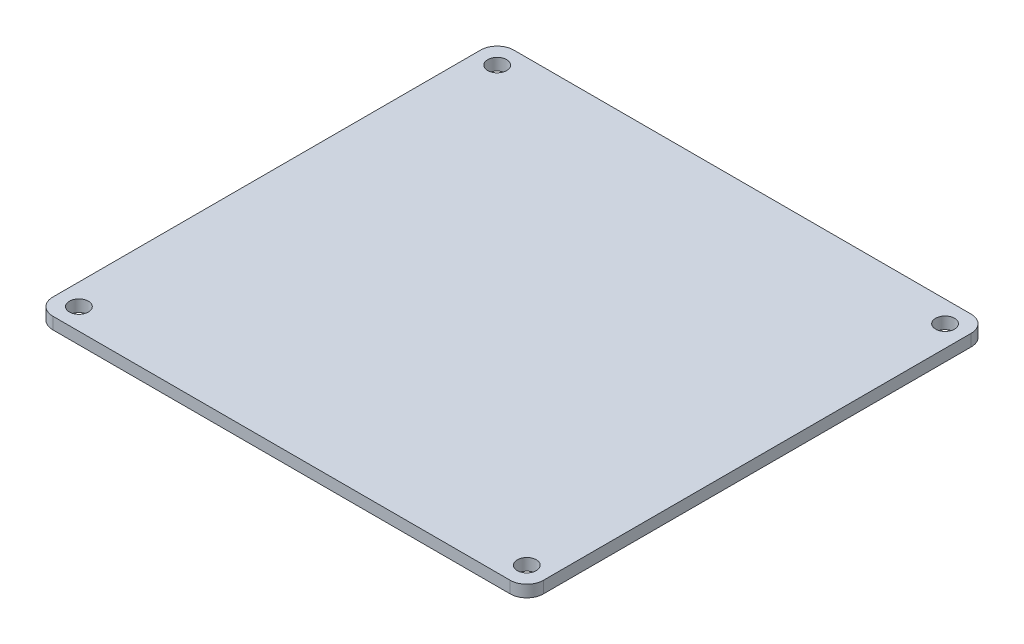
ISO-10303-21;
HEADER;
FILE_DESCRIPTION(('STEP AP214'),'2;1');
FILE_NAME('part.step','',(''),(''),'','','');
FILE_SCHEMA(('AUTOMOTIVE_DESIGN { 1 0 10303 214 1 1 1 1 }'));
ENDSEC;
DATA;
#1=APPLICATION_CONTEXT('core data for automotive mechanical design processes');
#2=APPLICATION_PROTOCOL_DEFINITION('international standard','automotive_design',2000,#1);
#3=PRODUCT_CONTEXT('',#1,'mechanical');
#4=PRODUCT('Part','Part','',(#3));
#5=PRODUCT_RELATED_PRODUCT_CATEGORY('part','',(#4));
#6=PRODUCT_DEFINITION_FORMATION('','',#4);
#7=PRODUCT_DEFINITION_CONTEXT('part definition',#1,'design');
#8=PRODUCT_DEFINITION('design','',#6,#7);
#9=PRODUCT_DEFINITION_SHAPE('','',#8);
#10=(LENGTH_UNIT() NAMED_UNIT(*) SI_UNIT(.MILLI.,.METRE.));
#11=(NAMED_UNIT(*) PLANE_ANGLE_UNIT() SI_UNIT($,.RADIAN.));
#12=(NAMED_UNIT(*) SI_UNIT($,.STERADIAN.) SOLID_ANGLE_UNIT());
#13=UNCERTAINTY_MEASURE_WITH_UNIT(LENGTH_MEASURE(1.E-05),#10,'distance_accuracy_value','');
#14=(GEOMETRIC_REPRESENTATION_CONTEXT(3) GLOBAL_UNCERTAINTY_ASSIGNED_CONTEXT((#13)) GLOBAL_UNIT_ASSIGNED_CONTEXT((#10,
#11,#12)) REPRESENTATION_CONTEXT('',''));
#15=CARTESIAN_POINT('',(0.,0.,0.));
#16=DIRECTION('',(0.,0.,1.));
#17=DIRECTION('',(1.,0.,0.));
#18=AXIS2_PLACEMENT_3D('',#15,#16,#17);
#19=CARTESIAN_POINT('',(2.8,2.,-75.));
#20=DIRECTION('',(0.,1.,0.));
#21=DIRECTION('',(0.,0.,1.));
#22=AXIS2_PLACEMENT_3D('',#19,#20,#21);
#23=PLANE('',#22);
#24=CARTESIAN_POINT('',(79.2,2.,-74.2));
#25=DIRECTION('',(0.,1.,0.));
#26=DIRECTION('',(0.,0.,1.));
#27=AXIS2_PLACEMENT_3D('',#24,#25,#26);
#28=CIRCLE('',#27,1.60000000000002);
#29=CARTESIAN_POINT('',(79.2,2.,-72.6));
#30=VERTEX_POINT('',#29);
#31=EDGE_CURVE('E232',#30,#30,#28,.T.);
#32=ORIENTED_EDGE('',*,*,#31,.F.);
#33=EDGE_LOOP('',(#32));
#34=FACE_BOUND('',#33,.T.);
#35=CARTESIAN_POINT('',(3.6,2.,-3.6));
#36=DIRECTION('',(0.,1.,0.));
#37=DIRECTION('',(0.,0.,1.));
#38=AXIS2_PLACEMENT_3D('',#35,#36,#37);
#39=CIRCLE('',#38,1.6);
#40=CARTESIAN_POINT('',(3.6,2.,-2.));
#41=VERTEX_POINT('',#40);
#42=EDGE_CURVE('E114',#41,#41,#39,.T.);
#43=ORIENTED_EDGE('',*,*,#42,.F.);
#44=EDGE_LOOP('',(#43));
#45=FACE_BOUND('',#44,.T.);
#46=CARTESIAN_POINT('',(2.8,2.,-75.));
#47=DIRECTION('',(0.,1.,0.));
#48=DIRECTION('',(0.,0.,1.));
#49=AXIS2_PLACEMENT_3D('',#46,#47,#48);
#50=CIRCLE('',#49,2.8);
#51=CARTESIAN_POINT('',(2.80000000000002,2.,-77.8));
#52=VERTEX_POINT('',#51);
#53=CARTESIAN_POINT('',(0.,2.,-75.));
#54=VERTEX_POINT('',#53);
#55=EDGE_CURVE('E132',#52,#54,#50,.T.);
#56=ORIENTED_EDGE('',*,*,#55,.T.);
#57=DIRECTION('',(0.,0.,1.));
#58=VECTOR('',#57,1.);
#59=CARTESIAN_POINT('',(0.,2.,-75.));
#60=LINE('',#59,#58);
#61=CARTESIAN_POINT('',(0.,2.,-2.80000000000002));
#62=VERTEX_POINT('',#61);
#63=EDGE_CURVE('E109',#54,#62,#60,.T.);
#64=ORIENTED_EDGE('',*,*,#63,.T.);
#65=CARTESIAN_POINT('',(2.8,2.,-2.8));
#66=DIRECTION('',(0.,1.,0.));
#67=DIRECTION('',(0.,0.,1.));
#68=AXIS2_PLACEMENT_3D('',#65,#66,#67);
#69=CIRCLE('',#68,2.8);
#70=CARTESIAN_POINT('',(2.80000000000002,2.,0.));
#71=VERTEX_POINT('',#70);
#72=EDGE_CURVE('E135',#62,#71,#69,.T.);
#73=ORIENTED_EDGE('',*,*,#72,.T.);
#74=DIRECTION('',(1.,0.,0.));
#75=VECTOR('',#74,1.);
#76=CARTESIAN_POINT('',(2.80000000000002,2.,0.));
#77=LINE('',#76,#75);
#78=CARTESIAN_POINT('',(80.,2.,0.));
#79=VERTEX_POINT('',#78);
#80=EDGE_CURVE('E137',#71,#79,#77,.T.);
#81=ORIENTED_EDGE('',*,*,#80,.T.);
#82=CARTESIAN_POINT('',(80.,2.,-2.8));
#83=DIRECTION('',(0.,1.,0.));
#84=DIRECTION('',(0.,0.,1.));
#85=AXIS2_PLACEMENT_3D('',#82,#83,#84);
#86=CIRCLE('',#85,2.8);
#87=CARTESIAN_POINT('',(82.8,2.,-2.80000000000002));
#88=VERTEX_POINT('',#87);
#89=EDGE_CURVE('E139',#79,#88,#86,.T.);
#90=ORIENTED_EDGE('',*,*,#89,.T.);
#91=DIRECTION('',(0.,0.,-1.));
#92=VECTOR('',#91,1.);
#93=CARTESIAN_POINT('',(82.8,2.,-75.));
#94=LINE('',#93,#92);
#95=CARTESIAN_POINT('',(82.8,2.,-75.));
#96=VERTEX_POINT('',#95);
#97=EDGE_CURVE('E141',#88,#96,#94,.T.);
#98=ORIENTED_EDGE('',*,*,#97,.T.);
#99=CARTESIAN_POINT('',(80.,2.,-75.));
#100=DIRECTION('',(0.,1.,0.));
#101=DIRECTION('',(0.,0.,-1.));
#102=AXIS2_PLACEMENT_3D('',#99,#100,#101);
#103=CIRCLE('',#102,2.8);
#104=CARTESIAN_POINT('',(80.,2.,-77.8));
#105=VERTEX_POINT('',#104);
#106=EDGE_CURVE('E50',#96,#105,#103,.T.);
#107=ORIENTED_EDGE('',*,*,#106,.T.);
#108=DIRECTION('',(-1.,0.,0.));
#109=VECTOR('',#108,1.);
#110=CARTESIAN_POINT('',(2.80000000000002,2.,-77.8));
#111=LINE('',#110,#109);
#112=EDGE_CURVE('E45',#105,#52,#111,.T.);
#113=ORIENTED_EDGE('',*,*,#112,.T.);
#114=EDGE_LOOP('',(#56,#64,#73,#81,#90,#98,#107,#113));
#115=FACE_BOUND('',#114,.T.);
#116=CARTESIAN_POINT('',(79.2,2.,-3.6));
#117=DIRECTION('',(0.,1.,0.));
#118=DIRECTION('',(0.,0.,-1.));
#119=AXIS2_PLACEMENT_3D('',#116,#117,#118);
#120=CIRCLE('',#119,1.60000000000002);
#121=CARTESIAN_POINT('',(79.2,2.,-5.20000000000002));
#122=VERTEX_POINT('',#121);
#123=EDGE_CURVE('E238',#122,#122,#120,.T.);
#124=ORIENTED_EDGE('',*,*,#123,.F.);
#125=EDGE_LOOP('',(#124));
#126=FACE_BOUND('',#125,.T.);
#127=CARTESIAN_POINT('',(3.6,2.,-74.2));
#128=DIRECTION('',(0.,1.,0.));
#129=DIRECTION('',(0.,0.,-1.));
#130=AXIS2_PLACEMENT_3D('',#127,#128,#129);
#131=CIRCLE('',#130,1.60000000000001);
#132=CARTESIAN_POINT('',(3.6,2.,-75.8));
#133=VERTEX_POINT('',#132);
#134=EDGE_CURVE('E221',#133,#133,#131,.T.);
#135=ORIENTED_EDGE('',*,*,#134,.F.);
#136=EDGE_LOOP('',(#135));
#137=FACE_BOUND('',#136,.T.);
#138=ADVANCED_FACE('F30',(#34,#45,#115,#126,#137),#23,.T.);
#139=CARTESIAN_POINT('',(2.8,0.,-75.));
#140=DIRECTION('',(0.,1.,0.));
#141=DIRECTION('',(0.,0.,1.));
#142=AXIS2_PLACEMENT_3D('',#139,#140,#141);
#143=PLANE('',#142);
#144=CARTESIAN_POINT('',(79.2,0.,-74.2));
#145=DIRECTION('',(0.,1.,0.));
#146=DIRECTION('',(0.,0.,1.));
#147=AXIS2_PLACEMENT_3D('',#144,#145,#146);
#148=CIRCLE('',#147,1.60000000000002);
#149=CARTESIAN_POINT('',(79.2,0.,-72.6));
#150=VERTEX_POINT('',#149);
#151=EDGE_CURVE('E227',#150,#150,#148,.T.);
#152=ORIENTED_EDGE('',*,*,#151,.T.);
#153=EDGE_LOOP('',(#152));
#154=FACE_BOUND('',#153,.T.);
#155=CARTESIAN_POINT('',(3.6,0.,-3.6));
#156=DIRECTION('',(0.,1.,0.));
#157=DIRECTION('',(0.,0.,1.));
#158=AXIS2_PLACEMENT_3D('',#155,#156,#157);
#159=CIRCLE('',#158,1.6);
#160=CARTESIAN_POINT('',(3.6,0.,-2.));
#161=VERTEX_POINT('',#160);
#162=EDGE_CURVE('E117',#161,#161,#159,.T.);
#163=ORIENTED_EDGE('',*,*,#162,.T.);
#164=EDGE_LOOP('',(#163));
#165=FACE_BOUND('',#164,.T.);
#166=CARTESIAN_POINT('',(2.8,0.,-75.));
#167=DIRECTION('',(0.,1.,0.));
#168=DIRECTION('',(0.,0.,1.));
#169=AXIS2_PLACEMENT_3D('',#166,#167,#168);
#170=CIRCLE('',#169,2.8);
#171=CARTESIAN_POINT('',(2.80000000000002,0.,-77.8));
#172=VERTEX_POINT('',#171);
#173=CARTESIAN_POINT('',(0.,0.,-75.));
#174=VERTEX_POINT('',#173);
#175=EDGE_CURVE('E100',#172,#174,#170,.T.);
#176=ORIENTED_EDGE('',*,*,#175,.F.);
#177=DIRECTION('',(-1.,0.,0.));
#178=VECTOR('',#177,1.);
#179=CARTESIAN_POINT('',(2.80000000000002,0.,-77.8));
#180=LINE('',#179,#178);
#181=CARTESIAN_POINT('',(80.,0.,-77.8));
#182=VERTEX_POINT('',#181);
#183=EDGE_CURVE('E130',#182,#172,#180,.T.);
#184=ORIENTED_EDGE('',*,*,#183,.F.);
#185=CARTESIAN_POINT('',(80.,0.,-75.));
#186=DIRECTION('',(0.,1.,0.));
#187=DIRECTION('',(0.,0.,-1.));
#188=AXIS2_PLACEMENT_3D('',#185,#186,#187);
#189=CIRCLE('',#188,2.8);
#190=CARTESIAN_POINT('',(82.8,0.,-75.));
#191=VERTEX_POINT('',#190);
#192=EDGE_CURVE('E128',#191,#182,#189,.T.);
#193=ORIENTED_EDGE('',*,*,#192,.F.);
#194=DIRECTION('',(0.,0.,-1.));
#195=VECTOR('',#194,1.);
#196=CARTESIAN_POINT('',(82.8,0.,-75.));
#197=LINE('',#196,#195);
#198=CARTESIAN_POINT('',(82.8,0.,-2.80000000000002));
#199=VERTEX_POINT('',#198);
#200=EDGE_CURVE('E126',#199,#191,#197,.T.);
#201=ORIENTED_EDGE('',*,*,#200,.F.);
#202=CARTESIAN_POINT('',(80.,0.,-2.8));
#203=DIRECTION('',(0.,1.,0.));
#204=DIRECTION('',(0.,0.,1.));
#205=AXIS2_PLACEMENT_3D('',#202,#203,#204);
#206=CIRCLE('',#205,2.8);
#207=CARTESIAN_POINT('',(80.,0.,0.));
#208=VERTEX_POINT('',#207);
#209=EDGE_CURVE('E124',#208,#199,#206,.T.);
#210=ORIENTED_EDGE('',*,*,#209,.F.);
#211=DIRECTION('',(1.,0.,0.));
#212=VECTOR('',#211,1.);
#213=CARTESIAN_POINT('',(2.80000000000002,0.,0.));
#214=LINE('',#213,#212);
#215=CARTESIAN_POINT('',(2.80000000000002,0.,0.));
#216=VERTEX_POINT('',#215);
#217=EDGE_CURVE('E122',#216,#208,#214,.T.);
#218=ORIENTED_EDGE('',*,*,#217,.F.);
#219=CARTESIAN_POINT('',(2.8,0.,-2.8));
#220=DIRECTION('',(0.,1.,0.));
#221=DIRECTION('',(0.,0.,1.));
#222=AXIS2_PLACEMENT_3D('',#219,#220,#221);
#223=CIRCLE('',#222,2.8);
#224=CARTESIAN_POINT('',(0.,0.,-2.80000000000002));
#225=VERTEX_POINT('',#224);
#226=EDGE_CURVE('E102',#225,#216,#223,.T.);
#227=ORIENTED_EDGE('',*,*,#226,.F.);
#228=DIRECTION('',(0.,0.,1.));
#229=VECTOR('',#228,1.);
#230=CARTESIAN_POINT('',(0.,0.,-75.));
#231=LINE('',#230,#229);
#232=EDGE_CURVE('E95',#174,#225,#231,.T.);
#233=ORIENTED_EDGE('',*,*,#232,.F.);
#234=EDGE_LOOP('',(#176,#184,#193,#201,#210,#218,#227,#233));
#235=FACE_BOUND('',#234,.T.);
#236=CARTESIAN_POINT('',(79.2,0.,-3.6));
#237=DIRECTION('',(0.,1.,0.));
#238=DIRECTION('',(0.,0.,-1.));
#239=AXIS2_PLACEMENT_3D('',#236,#237,#238);
#240=CIRCLE('',#239,1.60000000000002);
#241=CARTESIAN_POINT('',(79.2,0.,-5.20000000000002));
#242=VERTEX_POINT('',#241);
#243=EDGE_CURVE('E235',#242,#242,#240,.T.);
#244=ORIENTED_EDGE('',*,*,#243,.T.);
#245=EDGE_LOOP('',(#244));
#246=FACE_BOUND('',#245,.T.);
#247=CARTESIAN_POINT('',(3.6,0.,-74.2));
#248=DIRECTION('',(0.,1.,0.));
#249=DIRECTION('',(0.,0.,-1.));
#250=AXIS2_PLACEMENT_3D('',#247,#248,#249);
#251=CIRCLE('',#250,1.60000000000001);
#252=CARTESIAN_POINT('',(3.6,0.,-75.8));
#253=VERTEX_POINT('',#252);
#254=EDGE_CURVE('E224',#253,#253,#251,.T.);
#255=ORIENTED_EDGE('',*,*,#254,.T.);
#256=EDGE_LOOP('',(#255));
#257=FACE_BOUND('',#256,.T.);
#258=ADVANCED_FACE('F96',(#154,#165,#235,#246,#257),#143,.F.);
#259=CARTESIAN_POINT('',(2.8,2.,-75.));
#260=DIRECTION('',(0.,-1.,0.));
#261=DIRECTION('',(0.,0.,-1.));
#262=AXIS2_PLACEMENT_3D('',#259,#260,#261);
#263=CYLINDRICAL_SURFACE('',#262,2.8);
#264=ORIENTED_EDGE('',*,*,#175,.T.);
#265=DIRECTION('',(0.,-1.,0.));
#266=VECTOR('',#265,1.);
#267=CARTESIAN_POINT('',(0.,2.,-75.));
#268=LINE('',#267,#266);
#269=EDGE_CURVE('E11',#54,#174,#268,.T.);
#270=ORIENTED_EDGE('',*,*,#269,.F.);
#271=ORIENTED_EDGE('',*,*,#55,.F.);
#272=DIRECTION('',(0.,-1.,0.));
#273=VECTOR('',#272,1.);
#274=CARTESIAN_POINT('',(2.80000000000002,2.,-77.8));
#275=LINE('',#274,#273);
#276=EDGE_CURVE('E113',#52,#172,#275,.T.);
#277=ORIENTED_EDGE('',*,*,#276,.T.);
#278=EDGE_LOOP('',(#264,#270,#271,#277));
#279=FACE_BOUND('',#278,.T.);
#280=ADVANCED_FACE('F32',(#279),#263,.T.);
#281=CARTESIAN_POINT('',(0.,2.,-75.));
#282=DIRECTION('',(1.,0.,0.));
#283=DIRECTION('',(0.,0.,-1.));
#284=AXIS2_PLACEMENT_3D('',#281,#282,#283);
#285=PLANE('',#284);
#286=ORIENTED_EDGE('',*,*,#232,.T.);
#287=DIRECTION('',(0.,-1.,0.));
#288=VECTOR('',#287,1.);
#289=CARTESIAN_POINT('',(0.,2.,-2.80000000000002));
#290=LINE('',#289,#288);
#291=EDGE_CURVE('E38',#62,#225,#290,.T.);
#292=ORIENTED_EDGE('',*,*,#291,.F.);
#293=ORIENTED_EDGE('',*,*,#63,.F.);
#294=ORIENTED_EDGE('',*,*,#269,.T.);
#295=EDGE_LOOP('',(#286,#292,#293,#294));
#296=FACE_BOUND('',#295,.T.);
#297=ADVANCED_FACE('F108',(#296),#285,.F.);
#298=CARTESIAN_POINT('',(2.8,2.,-2.8));
#299=DIRECTION('',(0.,-1.,0.));
#300=DIRECTION('',(0.,0.,-1.));
#301=AXIS2_PLACEMENT_3D('',#298,#299,#300);
#302=CYLINDRICAL_SURFACE('',#301,2.8);
#303=ORIENTED_EDGE('',*,*,#226,.T.);
#304=DIRECTION('',(0.,-1.,0.));
#305=VECTOR('',#304,1.);
#306=CARTESIAN_POINT('',(2.80000000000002,2.,0.));
#307=LINE('',#306,#305);
#308=EDGE_CURVE('E158',#71,#216,#307,.T.);
#309=ORIENTED_EDGE('',*,*,#308,.F.);
#310=ORIENTED_EDGE('',*,*,#72,.F.);
#311=ORIENTED_EDGE('',*,*,#291,.T.);
#312=EDGE_LOOP('',(#303,#309,#310,#311));
#313=FACE_BOUND('',#312,.T.);
#314=ADVANCED_FACE('F162',(#313),#302,.T.);
#315=CARTESIAN_POINT('',(2.80000000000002,2.,0.));
#316=DIRECTION('',(0.,0.,-1.));
#317=DIRECTION('',(-1.,0.,0.));
#318=AXIS2_PLACEMENT_3D('',#315,#316,#317);
#319=PLANE('',#318);
#320=ORIENTED_EDGE('',*,*,#217,.T.);
#321=DIRECTION('',(0.,-1.,0.));
#322=VECTOR('',#321,1.);
#323=CARTESIAN_POINT('',(80.,2.,0.));
#324=LINE('',#323,#322);
#325=EDGE_CURVE('E155',#79,#208,#324,.T.);
#326=ORIENTED_EDGE('',*,*,#325,.F.);
#327=ORIENTED_EDGE('',*,*,#80,.F.);
#328=ORIENTED_EDGE('',*,*,#308,.T.);
#329=EDGE_LOOP('',(#320,#326,#327,#328));
#330=FACE_BOUND('',#329,.T.);
#331=ADVANCED_FACE('F170',(#330),#319,.F.);
#332=CARTESIAN_POINT('',(80.,2.,-2.8));
#333=DIRECTION('',(0.,-1.,0.));
#334=DIRECTION('',(0.,0.,-1.));
#335=AXIS2_PLACEMENT_3D('',#332,#333,#334);
#336=CYLINDRICAL_SURFACE('',#335,2.8);
#337=ORIENTED_EDGE('',*,*,#209,.T.);
#338=DIRECTION('',(0.,-1.,0.));
#339=VECTOR('',#338,1.);
#340=CARTESIAN_POINT('',(82.8,2.,-2.80000000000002));
#341=LINE('',#340,#339);
#342=EDGE_CURVE('E152',#88,#199,#341,.T.);
#343=ORIENTED_EDGE('',*,*,#342,.F.);
#344=ORIENTED_EDGE('',*,*,#89,.F.);
#345=ORIENTED_EDGE('',*,*,#325,.T.);
#346=EDGE_LOOP('',(#337,#343,#344,#345));
#347=FACE_BOUND('',#346,.T.);
#348=ADVANCED_FACE('F173',(#347),#336,.T.);
#349=CARTESIAN_POINT('',(82.8,2.,-75.));
#350=DIRECTION('',(-1.,0.,0.));
#351=DIRECTION('',(0.,0.,1.));
#352=AXIS2_PLACEMENT_3D('',#349,#350,#351);
#353=PLANE('',#352);
#354=ORIENTED_EDGE('',*,*,#200,.T.);
#355=DIRECTION('',(0.,-1.,0.));
#356=VECTOR('',#355,1.);
#357=CARTESIAN_POINT('',(82.8,2.,-75.));
#358=LINE('',#357,#356);
#359=EDGE_CURVE('E149',#96,#191,#358,.T.);
#360=ORIENTED_EDGE('',*,*,#359,.F.);
#361=ORIENTED_EDGE('',*,*,#97,.F.);
#362=ORIENTED_EDGE('',*,*,#342,.T.);
#363=EDGE_LOOP('',(#354,#360,#361,#362));
#364=FACE_BOUND('',#363,.T.);
#365=ADVANCED_FACE('F178',(#364),#353,.F.);
#366=CARTESIAN_POINT('',(80.,2.,-75.));
#367=DIRECTION('',(0.,-1.,0.));
#368=DIRECTION('',(0.,0.,-1.));
#369=AXIS2_PLACEMENT_3D('',#366,#367,#368);
#370=CYLINDRICAL_SURFACE('',#369,2.8);
#371=ORIENTED_EDGE('',*,*,#192,.T.);
#372=DIRECTION('',(0.,-1.,0.));
#373=VECTOR('',#372,1.);
#374=CARTESIAN_POINT('',(80.,2.,-77.8));
#375=LINE('',#374,#373);
#376=EDGE_CURVE('E146',#105,#182,#375,.T.);
#377=ORIENTED_EDGE('',*,*,#376,.F.);
#378=ORIENTED_EDGE('',*,*,#106,.F.);
#379=ORIENTED_EDGE('',*,*,#359,.T.);
#380=EDGE_LOOP('',(#371,#377,#378,#379));
#381=FACE_BOUND('',#380,.T.);
#382=ADVANCED_FACE('F181',(#381),#370,.T.);
#383=CARTESIAN_POINT('',(2.80000000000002,2.,-77.8));
#384=DIRECTION('',(0.,0.,1.));
#385=DIRECTION('',(1.,0.,0.));
#386=AXIS2_PLACEMENT_3D('',#383,#384,#385);
#387=PLANE('',#386);
#388=ORIENTED_EDGE('',*,*,#183,.T.);
#389=ORIENTED_EDGE('',*,*,#276,.F.);
#390=ORIENTED_EDGE('',*,*,#112,.F.);
#391=ORIENTED_EDGE('',*,*,#376,.T.);
#392=EDGE_LOOP('',(#388,#389,#390,#391));
#393=FACE_BOUND('',#392,.T.);
#394=ADVANCED_FACE('F183',(#393),#387,.F.);
#395=CARTESIAN_POINT('',(3.6,2.,-3.6));
#396=DIRECTION('',(0.,-1.,0.));
#397=DIRECTION('',(0.,0.,-1.));
#398=AXIS2_PLACEMENT_3D('',#395,#396,#397);
#399=CYLINDRICAL_SURFACE('',#398,1.6);
#400=ORIENTED_EDGE('',*,*,#42,.T.);
#401=EDGE_LOOP('',(#400));
#402=FACE_BOUND('',#401,.T.);
#403=ORIENTED_EDGE('',*,*,#162,.F.);
#404=EDGE_LOOP('',(#403));
#405=FACE_BOUND('',#404,.T.);
#406=ADVANCED_FACE('F185',(#402,#405),#399,.F.);
#407=CARTESIAN_POINT('',(79.2,2.,-3.6));
#408=DIRECTION('',(0.,-1.,0.));
#409=DIRECTION('',(0.,0.,-1.));
#410=AXIS2_PLACEMENT_3D('',#407,#408,#409);
#411=CYLINDRICAL_SURFACE('',#410,1.60000000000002);
#412=ORIENTED_EDGE('',*,*,#123,.T.);
#413=EDGE_LOOP('',(#412));
#414=FACE_BOUND('',#413,.T.);
#415=ORIENTED_EDGE('',*,*,#243,.F.);
#416=EDGE_LOOP('',(#415));
#417=FACE_BOUND('',#416,.T.);
#418=ADVANCED_FACE('F191',(#414,#417),#411,.F.);
#419=CARTESIAN_POINT('',(79.2,2.,-74.2));
#420=DIRECTION('',(0.,-1.,0.));
#421=DIRECTION('',(0.,0.,-1.));
#422=AXIS2_PLACEMENT_3D('',#419,#420,#421);
#423=CYLINDRICAL_SURFACE('',#422,1.60000000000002);
#424=ORIENTED_EDGE('',*,*,#31,.T.);
#425=EDGE_LOOP('',(#424));
#426=FACE_BOUND('',#425,.T.);
#427=ORIENTED_EDGE('',*,*,#151,.F.);
#428=EDGE_LOOP('',(#427));
#429=FACE_BOUND('',#428,.T.);
#430=ADVANCED_FACE('F208',(#426,#429),#423,.F.);
#431=CARTESIAN_POINT('',(3.6,2.,-74.2));
#432=DIRECTION('',(0.,-1.,0.));
#433=DIRECTION('',(0.,0.,-1.));
#434=AXIS2_PLACEMENT_3D('',#431,#432,#433);
#435=CYLINDRICAL_SURFACE('',#434,1.60000000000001);
#436=ORIENTED_EDGE('',*,*,#134,.T.);
#437=EDGE_LOOP('',(#436));
#438=FACE_BOUND('',#437,.T.);
#439=ORIENTED_EDGE('',*,*,#254,.F.);
#440=EDGE_LOOP('',(#439));
#441=FACE_BOUND('',#440,.T.);
#442=ADVANCED_FACE('F212',(#438,#441),#435,.F.);
#443=CLOSED_SHELL('',(#138,#258,#280,#297,#314,#331,#348,#365,#382,#394,#406,#418,#430,#442));
#444=MANIFOLD_SOLID_BREP('B2',#443);
#445=ADVANCED_BREP_SHAPE_REPRESENTATION('',(#18,#444),#14);
#446=SHAPE_DEFINITION_REPRESENTATION(#9,#445);
ENDSEC;
END-ISO-10303-21;
